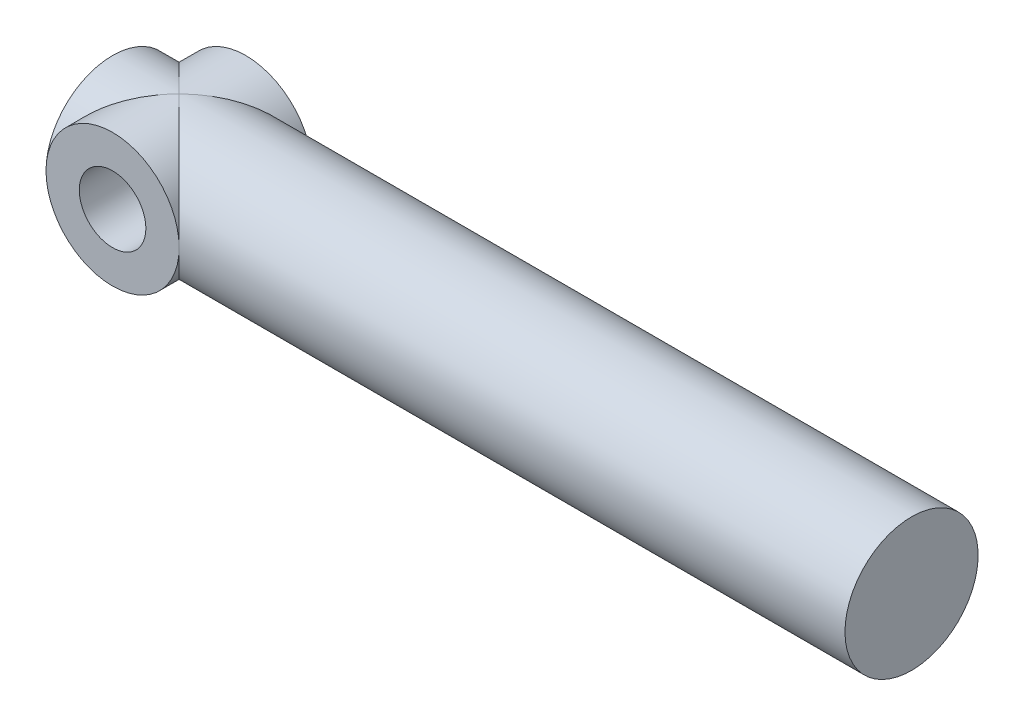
from build123d import *

# Parameters (mm, degrees)
SKETCH1_W           = 38.1
SKETCH1_H           = 3.175
SKETCH4_R           = 1.5875
CUT_EXTRUDE2_DEPTH  = 6.35
SKETCH8_R           = 3.175
SKETCH8_R_2         = 1.5875
BOSS_EXTRUDE2_DEPTH = 3.175


with BuildPart() as part:
    # Sketch1 → Revolve1 (revolve)
    with BuildSketch(Plane.XY, mode=Mode.PRIVATE) as revolve1_sk:
        with Locations((19.05, 1.5875)):
            Rectangle(SKETCH1_W, SKETCH1_H)
    revolve(revolve1_sk.sketch.rotate(Axis((0, 0, 0), (1, 0, 0)), 90), axis=Axis((0, 0, 0), (1, 0, 0)))

    # Sketch4 → Cut-Extrude2 (cut, symmetric)
    with BuildSketch(Plane.XY):
        with Locations(Location((3.175, 0, 0), (0, 0, 180))):
            Circle(SKETCH4_R)
    extrude(amount=CUT_EXTRUDE2_DEPTH, both=True, mode=Mode.SUBTRACT)

    # Sketch8 → Boss-Extrude2 (add, symmetric)
    with BuildSketch(Plane.XY):
        with Locations((3.175, 0)):
            Circle(SKETCH8_R)
        with Locations((3.175, 0)):
            Circle(SKETCH8_R_2, mode=Mode.SUBTRACT)
    extrude(amount=BOSS_EXTRUDE2_DEPTH, both=True)


solid = part.part
